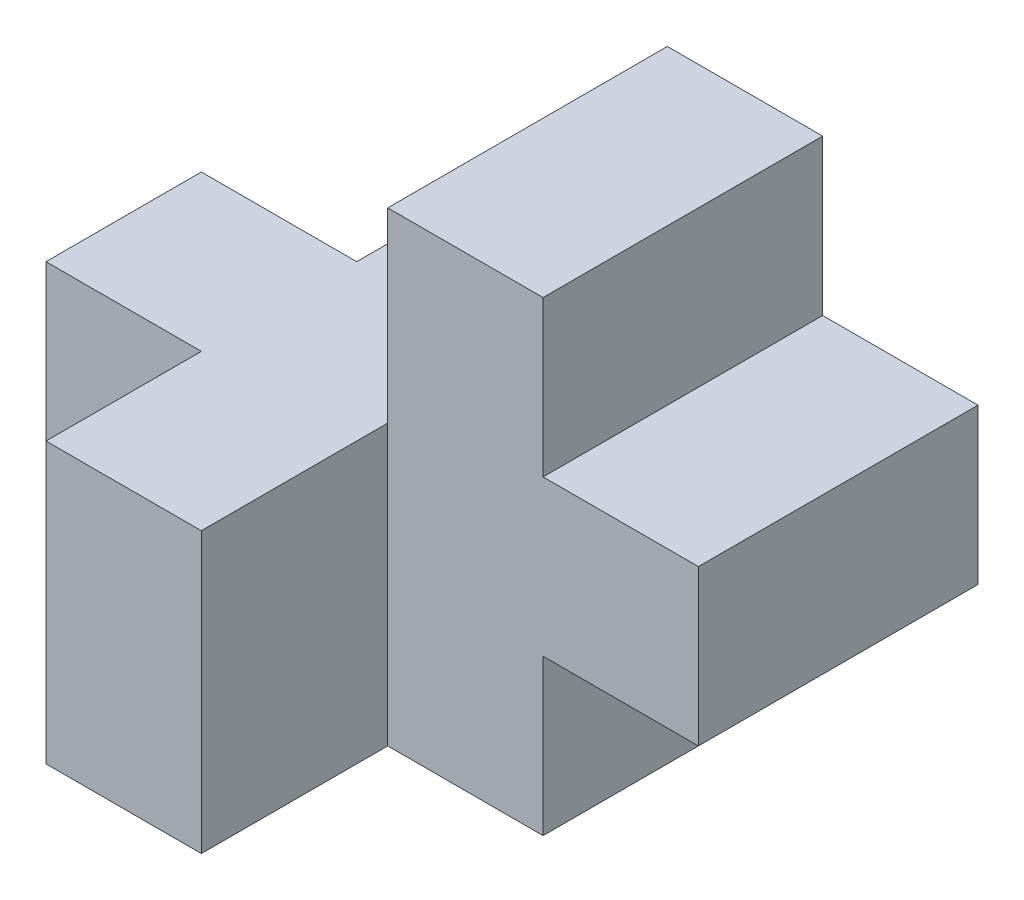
ISO-10303-21;
HEADER;
FILE_DESCRIPTION(('STEP AP214'),'2;1');
FILE_NAME('part.step','',(''),(''),'','','');
FILE_SCHEMA(('AUTOMOTIVE_DESIGN { 1 0 10303 214 1 1 1 1 }'));
ENDSEC;
DATA;
#1=APPLICATION_CONTEXT('core data for automotive mechanical design processes');
#2=APPLICATION_PROTOCOL_DEFINITION('international standard','automotive_design',2000,#1);
#3=PRODUCT_CONTEXT('',#1,'mechanical');
#4=PRODUCT('Part','Part','',(#3));
#5=PRODUCT_RELATED_PRODUCT_CATEGORY('part','',(#4));
#6=PRODUCT_DEFINITION_FORMATION('','',#4);
#7=PRODUCT_DEFINITION_CONTEXT('part definition',#1,'design');
#8=PRODUCT_DEFINITION('design','',#6,#7);
#9=PRODUCT_DEFINITION_SHAPE('','',#8);
#10=(LENGTH_UNIT() NAMED_UNIT(*) SI_UNIT(.MILLI.,.METRE.));
#11=(NAMED_UNIT(*) PLANE_ANGLE_UNIT() SI_UNIT($,.RADIAN.));
#12=(NAMED_UNIT(*) SI_UNIT($,.STERADIAN.) SOLID_ANGLE_UNIT());
#13=UNCERTAINTY_MEASURE_WITH_UNIT(LENGTH_MEASURE(1.E-05),#10,'distance_accuracy_value','');
#14=(GEOMETRIC_REPRESENTATION_CONTEXT(3) GLOBAL_UNCERTAINTY_ASSIGNED_CONTEXT((#13)) GLOBAL_UNIT_ASSIGNED_CONTEXT((#10,
#11,#12)) REPRESENTATION_CONTEXT('',''));
#15=CARTESIAN_POINT('',(0.,0.,0.));
#16=DIRECTION('',(0.,0.,1.));
#17=DIRECTION('',(1.,0.,0.));
#18=AXIS2_PLACEMENT_3D('',#15,#16,#17);
#19=CARTESIAN_POINT('',(0.,0.,-90.));
#20=DIRECTION('',(-1.,0.,0.));
#21=DIRECTION('',(0.,0.,1.));
#22=AXIS2_PLACEMENT_3D('',#19,#20,#21);
#23=PLANE('',#22);
#24=DIRECTION('',(0.,-1.,0.));
#25=VECTOR('',#24,1.);
#26=CARTESIAN_POINT('',(0.,-75.,-90.));
#27=LINE('',#26,#25);
#28=CARTESIAN_POINT('',(0.,75.,-90.));
#29=VERTEX_POINT('',#28);
#30=CARTESIAN_POINT('',(0.,15.,-90.));
#31=VERTEX_POINT('',#30);
#32=EDGE_CURVE('E57',#29,#31,#27,.T.);
#33=ORIENTED_EDGE('',*,*,#32,.T.);
#34=DIRECTION('',(0.,0.,1.));
#35=VECTOR('',#34,1.);
#36=CARTESIAN_POINT('',(0.,15.,60.));
#37=LINE('',#36,#35);
#38=CARTESIAN_POINT('',(0.,15.,0.));
#39=VERTEX_POINT('',#38);
#40=EDGE_CURVE('E225',#31,#39,#37,.T.);
#41=ORIENTED_EDGE('',*,*,#40,.T.);
#42=DIRECTION('',(0.,-1.,0.));
#43=VECTOR('',#42,1.);
#44=CARTESIAN_POINT('',(0.,0.,0.));
#45=LINE('',#44,#43);
#46=CARTESIAN_POINT('',(0.,75.,0.));
#47=VERTEX_POINT('',#46);
#48=EDGE_CURVE('E153',#47,#39,#45,.T.);
#49=ORIENTED_EDGE('',*,*,#48,.F.);
#50=DIRECTION('',(0.,0.,1.));
#51=VECTOR('',#50,1.);
#52=CARTESIAN_POINT('',(0.,75.,-90.));
#53=LINE('',#52,#51);
#54=EDGE_CURVE('E11',#29,#47,#53,.T.);
#55=ORIENTED_EDGE('',*,*,#54,.F.);
#56=EDGE_LOOP('',(#33,#41,#49,#55));
#57=FACE_BOUND('',#56,.T.);
#58=ADVANCED_FACE('F31',(#57),#23,.T.);
#59=CARTESIAN_POINT('',(0.,75.,-90.));
#60=DIRECTION('',(0.,1.,0.));
#61=DIRECTION('',(0.,0.,1.));
#62=AXIS2_PLACEMENT_3D('',#59,#60,#61);
#63=PLANE('',#62);
#64=DIRECTION('',(-1.,0.,0.));
#65=VECTOR('',#64,1.);
#66=CARTESIAN_POINT('',(0.,75.,0.));
#67=LINE('',#66,#65);
#68=CARTESIAN_POINT('',(50.,75.,0.));
#69=VERTEX_POINT('',#68);
#70=EDGE_CURVE('E150',#69,#47,#67,.T.);
#71=ORIENTED_EDGE('',*,*,#70,.F.);
#72=DIRECTION('',(0.,0.,1.));
#73=VECTOR('',#72,1.);
#74=CARTESIAN_POINT('',(50.,75.,-90.));
#75=LINE('',#74,#73);
#76=CARTESIAN_POINT('',(50.,75.,-90.));
#77=VERTEX_POINT('',#76);
#78=EDGE_CURVE('E40',#77,#69,#75,.T.);
#79=ORIENTED_EDGE('',*,*,#78,.F.);
#80=DIRECTION('',(-1.,0.,0.));
#81=VECTOR('',#80,1.);
#82=CARTESIAN_POINT('',(0.,75.,-90.));
#83=LINE('',#82,#81);
#84=EDGE_CURVE('E127',#77,#29,#83,.T.);
#85=ORIENTED_EDGE('',*,*,#84,.T.);
#86=ORIENTED_EDGE('',*,*,#54,.T.);
#87=EDGE_LOOP('',(#71,#79,#85,#86));
#88=FACE_BOUND('',#87,.T.);
#89=ADVANCED_FACE('F308',(#88),#63,.T.);
#90=CARTESIAN_POINT('',(50.,75.,-90.));
#91=DIRECTION('',(1.,0.,0.));
#92=DIRECTION('',(0.,1.,0.));
#93=AXIS2_PLACEMENT_3D('',#90,#91,#92);
#94=PLANE('',#93);
#95=DIRECTION('',(0.,1.,0.));
#96=VECTOR('',#95,1.);
#97=CARTESIAN_POINT('',(50.,75.,0.));
#98=LINE('',#97,#96);
#99=CARTESIAN_POINT('',(50.,25.,0.));
#100=VERTEX_POINT('',#99);
#101=EDGE_CURVE('E115',#100,#69,#98,.T.);
#102=ORIENTED_EDGE('',*,*,#101,.F.);
#103=DIRECTION('',(0.,0.,1.));
#104=VECTOR('',#103,1.);
#105=CARTESIAN_POINT('',(50.,25.,-90.));
#106=LINE('',#105,#104);
#107=CARTESIAN_POINT('',(50.,25.,-90.));
#108=VERTEX_POINT('',#107);
#109=EDGE_CURVE('E110',#108,#100,#106,.T.);
#110=ORIENTED_EDGE('',*,*,#109,.F.);
#111=DIRECTION('',(0.,1.,0.));
#112=VECTOR('',#111,1.);
#113=CARTESIAN_POINT('',(50.,75.,-90.));
#114=LINE('',#113,#112);
#115=EDGE_CURVE('E113',#108,#77,#114,.T.);
#116=ORIENTED_EDGE('',*,*,#115,.T.);
#117=ORIENTED_EDGE('',*,*,#78,.T.);
#118=EDGE_LOOP('',(#102,#110,#116,#117));
#119=FACE_BOUND('',#118,.T.);
#120=ADVANCED_FACE('F112',(#119),#94,.T.);
#121=CARTESIAN_POINT('',(50.,25.,-90.));
#122=DIRECTION('',(0.,1.,0.));
#123=DIRECTION('',(0.,0.,1.));
#124=AXIS2_PLACEMENT_3D('',#121,#122,#123);
#125=PLANE('',#124);
#126=DIRECTION('',(-1.,0.,0.));
#127=VECTOR('',#126,1.);
#128=CARTESIAN_POINT('',(50.,25.,0.));
#129=LINE('',#128,#127);
#130=CARTESIAN_POINT('',(100.,25.,0.));
#131=VERTEX_POINT('',#130);
#132=EDGE_CURVE('E147',#131,#100,#129,.T.);
#133=ORIENTED_EDGE('',*,*,#132,.F.);
#134=DIRECTION('',(0.,0.,1.));
#135=VECTOR('',#134,1.);
#136=CARTESIAN_POINT('',(100.,25.,-90.));
#137=LINE('',#136,#135);
#138=CARTESIAN_POINT('',(100.,25.,-90.));
#139=VERTEX_POINT('',#138);
#140=EDGE_CURVE('E120',#139,#131,#137,.T.);
#141=ORIENTED_EDGE('',*,*,#140,.F.);
#142=DIRECTION('',(-1.,0.,0.));
#143=VECTOR('',#142,1.);
#144=CARTESIAN_POINT('',(50.,25.,-90.));
#145=LINE('',#144,#143);
#146=EDGE_CURVE('E125',#139,#108,#145,.T.);
#147=ORIENTED_EDGE('',*,*,#146,.T.);
#148=ORIENTED_EDGE('',*,*,#109,.T.);
#149=EDGE_LOOP('',(#133,#141,#147,#148));
#150=FACE_BOUND('',#149,.T.);
#151=ADVANCED_FACE('F129',(#150),#125,.T.);
#152=CARTESIAN_POINT('',(100.,25.,-90.));
#153=DIRECTION('',(1.,0.,0.));
#154=DIRECTION('',(0.,0.,-1.));
#155=AXIS2_PLACEMENT_3D('',#152,#153,#154);
#156=PLANE('',#155);
#157=DIRECTION('',(0.,1.,0.));
#158=VECTOR('',#157,1.);
#159=CARTESIAN_POINT('',(100.,25.,0.));
#160=LINE('',#159,#158);
#161=CARTESIAN_POINT('',(100.,-25.,0.));
#162=VERTEX_POINT('',#161);
#163=EDGE_CURVE('E144',#162,#131,#160,.T.);
#164=ORIENTED_EDGE('',*,*,#163,.F.);
#165=DIRECTION('',(0.,0.,1.));
#166=VECTOR('',#165,1.);
#167=CARTESIAN_POINT('',(100.,-25.,-90.));
#168=LINE('',#167,#166);
#169=CARTESIAN_POINT('',(100.,-25.,-90.));
#170=VERTEX_POINT('',#169);
#171=EDGE_CURVE('E339',#170,#162,#168,.T.);
#172=ORIENTED_EDGE('',*,*,#171,.F.);
#173=DIRECTION('',(0.,1.,0.));
#174=VECTOR('',#173,1.);
#175=CARTESIAN_POINT('',(100.,25.,-90.));
#176=LINE('',#175,#174);
#177=EDGE_CURVE('E130',#170,#139,#176,.T.);
#178=ORIENTED_EDGE('',*,*,#177,.T.);
#179=ORIENTED_EDGE('',*,*,#140,.T.);
#180=EDGE_LOOP('',(#164,#172,#178,#179));
#181=FACE_BOUND('',#180,.T.);
#182=ADVANCED_FACE('F322',(#181),#156,.T.);
#183=CARTESIAN_POINT('',(100.,-25.,-90.));
#184=DIRECTION('',(0.,-1.,0.));
#185=DIRECTION('',(1.,0.,0.));
#186=AXIS2_PLACEMENT_3D('',#183,#184,#185);
#187=PLANE('',#186);
#188=DIRECTION('',(1.,0.,0.));
#189=VECTOR('',#188,1.);
#190=CARTESIAN_POINT('',(100.,-25.,0.));
#191=LINE('',#190,#189);
#192=CARTESIAN_POINT('',(50.,-25.,0.));
#193=VERTEX_POINT('',#192);
#194=EDGE_CURVE('E140',#193,#162,#191,.T.);
#195=ORIENTED_EDGE('',*,*,#194,.F.);
#196=DIRECTION('',(0.,0.,1.));
#197=VECTOR('',#196,1.);
#198=CARTESIAN_POINT('',(50.,-25.,-90.));
#199=LINE('',#198,#197);
#200=CARTESIAN_POINT('',(50.,-25.,-90.));
#201=VERTEX_POINT('',#200);
#202=EDGE_CURVE('E334',#201,#193,#199,.T.);
#203=ORIENTED_EDGE('',*,*,#202,.F.);
#204=DIRECTION('',(1.,0.,0.));
#205=VECTOR('',#204,1.);
#206=CARTESIAN_POINT('',(100.,-25.,-90.));
#207=LINE('',#206,#205);
#208=EDGE_CURVE('E132',#201,#170,#207,.T.);
#209=ORIENTED_EDGE('',*,*,#208,.T.);
#210=ORIENTED_EDGE('',*,*,#171,.T.);
#211=EDGE_LOOP('',(#195,#203,#209,#210));
#212=FACE_BOUND('',#211,.T.);
#213=ADVANCED_FACE('F325',(#212),#187,.T.);
#214=CARTESIAN_POINT('',(50.,-25.,-90.));
#215=DIRECTION('',(1.,0.,0.));
#216=DIRECTION('',(0.,1.,0.));
#217=AXIS2_PLACEMENT_3D('',#214,#215,#216);
#218=PLANE('',#217);
#219=DIRECTION('',(0.,1.,0.));
#220=VECTOR('',#219,1.);
#221=CARTESIAN_POINT('',(50.,-25.,0.));
#222=LINE('',#221,#220);
#223=CARTESIAN_POINT('',(50.,-75.,0.));
#224=VERTEX_POINT('',#223);
#225=EDGE_CURVE('E137',#224,#193,#222,.T.);
#226=ORIENTED_EDGE('',*,*,#225,.F.);
#227=DIRECTION('',(0.,0.,1.));
#228=VECTOR('',#227,1.);
#229=CARTESIAN_POINT('',(50.,-75.,-90.));
#230=LINE('',#229,#228);
#231=CARTESIAN_POINT('',(50.,-75.,-90.));
#232=VERTEX_POINT('',#231);
#233=EDGE_CURVE('E94',#232,#224,#230,.T.);
#234=ORIENTED_EDGE('',*,*,#233,.F.);
#235=DIRECTION('',(0.,1.,0.));
#236=VECTOR('',#235,1.);
#237=CARTESIAN_POINT('',(50.,-25.,-90.));
#238=LINE('',#237,#236);
#239=EDGE_CURVE('E353',#232,#201,#238,.T.);
#240=ORIENTED_EDGE('',*,*,#239,.T.);
#241=ORIENTED_EDGE('',*,*,#202,.T.);
#242=EDGE_LOOP('',(#226,#234,#240,#241));
#243=FACE_BOUND('',#242,.T.);
#244=ADVANCED_FACE('F328',(#243),#218,.T.);
#245=CARTESIAN_POINT('',(50.,-75.,-90.));
#246=DIRECTION('',(0.,-1.,0.));
#247=DIRECTION('',(0.,0.,-1.));
#248=AXIS2_PLACEMENT_3D('',#245,#246,#247);
#249=PLANE('',#248);
#250=DIRECTION('',(1.,0.,0.));
#251=VECTOR('',#250,1.);
#252=CARTESIAN_POINT('',(50.,-75.,0.));
#253=LINE('',#252,#251);
#254=CARTESIAN_POINT('',(0.,-75.,0.));
#255=VERTEX_POINT('',#254);
#256=EDGE_CURVE('E141',#255,#224,#253,.T.);
#257=ORIENTED_EDGE('',*,*,#256,.F.);
#258=DIRECTION('',(0.,0.,1.));
#259=VECTOR('',#258,1.);
#260=CARTESIAN_POINT('',(0.,-75.,60.));
#261=LINE('',#260,#259);
#262=CARTESIAN_POINT('',(0.,-75.,60.));
#263=VERTEX_POINT('',#262);
#264=EDGE_CURVE('E197',#255,#263,#261,.T.);
#265=ORIENTED_EDGE('',*,*,#264,.T.);
#266=DIRECTION('',(-1.,0.,0.));
#267=VECTOR('',#266,1.);
#268=CARTESIAN_POINT('',(-50.,-75.,60.));
#269=LINE('',#268,#267);
#270=CARTESIAN_POINT('',(-50.,-75.,60.));
#271=VERTEX_POINT('',#270);
#272=EDGE_CURVE('E201',#263,#271,#269,.T.);
#273=ORIENTED_EDGE('',*,*,#272,.T.);
#274=DIRECTION('',(0.,0.,-1.));
#275=VECTOR('',#274,1.);
#276=CARTESIAN_POINT('',(-50.,-75.,10.));
#277=LINE('',#276,#275);
#278=CARTESIAN_POINT('',(-50.,-75.,10.));
#279=VERTEX_POINT('',#278);
#280=EDGE_CURVE('E211',#271,#279,#277,.T.);
#281=ORIENTED_EDGE('',*,*,#280,.T.);
#282=DIRECTION('',(-1.,0.,0.));
#283=VECTOR('',#282,1.);
#284=CARTESIAN_POINT('',(-100.,-75.,10.));
#285=LINE('',#284,#283);
#286=CARTESIAN_POINT('',(-100.,-75.,10.));
#287=VERTEX_POINT('',#286);
#288=EDGE_CURVE('E214',#279,#287,#285,.T.);
#289=ORIENTED_EDGE('',*,*,#288,.T.);
#290=DIRECTION('',(0.,0.,-1.));
#291=VECTOR('',#290,1.);
#292=CARTESIAN_POINT('',(-100.,-75.,-40.));
#293=LINE('',#292,#291);
#294=CARTESIAN_POINT('',(-100.,-75.,-40.));
#295=VERTEX_POINT('',#294);
#296=EDGE_CURVE('E217',#287,#295,#293,.T.);
#297=ORIENTED_EDGE('',*,*,#296,.T.);
#298=DIRECTION('',(1.,0.,0.));
#299=VECTOR('',#298,1.);
#300=CARTESIAN_POINT('',(-50.,-75.,-40.));
#301=LINE('',#300,#299);
#302=CARTESIAN_POINT('',(-50.,-75.,-40.));
#303=VERTEX_POINT('',#302);
#304=EDGE_CURVE('E219',#295,#303,#301,.T.);
#305=ORIENTED_EDGE('',*,*,#304,.T.);
#306=DIRECTION('',(0.,0.,-1.));
#307=VECTOR('',#306,1.);
#308=CARTESIAN_POINT('',(-50.,-75.,-90.));
#309=LINE('',#308,#307);
#310=CARTESIAN_POINT('',(-50.,-75.,-90.));
#311=VERTEX_POINT('',#310);
#312=EDGE_CURVE('E179',#303,#311,#309,.T.);
#313=ORIENTED_EDGE('',*,*,#312,.T.);
#314=DIRECTION('',(1.,0.,0.));
#315=VECTOR('',#314,1.);
#316=CARTESIAN_POINT('',(50.,-75.,-90.));
#317=LINE('',#316,#315);
#318=EDGE_CURVE('E351',#311,#232,#317,.T.);
#319=ORIENTED_EDGE('',*,*,#318,.T.);
#320=ORIENTED_EDGE('',*,*,#233,.T.);
#321=EDGE_LOOP('',(#257,#265,#273,#281,#289,#297,#305,#313,#319,#320));
#322=FACE_BOUND('',#321,.T.);
#323=ADVANCED_FACE('F33',(#322),#249,.T.);
#324=CARTESIAN_POINT('',(0.,75.,-90.));
#325=DIRECTION('',(0.,0.,-1.));
#326=DIRECTION('',(-1.,0.,0.));
#327=AXIS2_PLACEMENT_3D('',#324,#325,#326);
#328=PLANE('',#327);
#329=ORIENTED_EDGE('',*,*,#32,.F.);
#330=ORIENTED_EDGE('',*,*,#84,.F.);
#331=ORIENTED_EDGE('',*,*,#115,.F.);
#332=ORIENTED_EDGE('',*,*,#146,.F.);
#333=ORIENTED_EDGE('',*,*,#177,.F.);
#334=ORIENTED_EDGE('',*,*,#208,.F.);
#335=ORIENTED_EDGE('',*,*,#239,.F.);
#336=ORIENTED_EDGE('',*,*,#318,.F.);
#337=DIRECTION('',(0.,-1.,0.));
#338=VECTOR('',#337,1.);
#339=CARTESIAN_POINT('',(-50.,15.,-90.));
#340=LINE('',#339,#338);
#341=CARTESIAN_POINT('',(-50.,15.,-90.));
#342=VERTEX_POINT('',#341);
#343=EDGE_CURVE('E163',#342,#311,#340,.T.);
#344=ORIENTED_EDGE('',*,*,#343,.F.);
#345=DIRECTION('',(1.,0.,0.));
#346=VECTOR('',#345,1.);
#347=CARTESIAN_POINT('',(0.,15.,-90.));
#348=LINE('',#347,#346);
#349=EDGE_CURVE('E196',#342,#31,#348,.T.);
#350=ORIENTED_EDGE('',*,*,#349,.T.);
#351=EDGE_LOOP('',(#329,#330,#331,#332,#333,#334,#335,#336,#344,#350));
#352=FACE_BOUND('',#351,.T.);
#353=ADVANCED_FACE('F123',(#352),#328,.T.);
#354=CARTESIAN_POINT('',(0.,75.,0.));
#355=DIRECTION('',(0.,0.,-1.));
#356=DIRECTION('',(-1.,0.,0.));
#357=AXIS2_PLACEMENT_3D('',#354,#355,#356);
#358=PLANE('',#357);
#359=ORIENTED_EDGE('',*,*,#48,.T.);
#360=EDGE_CURVE('E152',#39,#255,#45,.T.);
#361=ORIENTED_EDGE('',*,*,#360,.T.);
#362=ORIENTED_EDGE('',*,*,#256,.T.);
#363=ORIENTED_EDGE('',*,*,#225,.T.);
#364=ORIENTED_EDGE('',*,*,#194,.T.);
#365=ORIENTED_EDGE('',*,*,#163,.T.);
#366=ORIENTED_EDGE('',*,*,#132,.T.);
#367=ORIENTED_EDGE('',*,*,#101,.T.);
#368=ORIENTED_EDGE('',*,*,#70,.T.);
#369=EDGE_LOOP('',(#359,#361,#362,#363,#364,#365,#366,#367,#368));
#370=FACE_BOUND('',#369,.T.);
#371=ADVANCED_FACE('F304',(#370),#358,.F.);
#372=CARTESIAN_POINT('',(0.,15.,60.));
#373=DIRECTION('',(1.,0.,0.));
#374=DIRECTION('',(0.,0.,-1.));
#375=AXIS2_PLACEMENT_3D('',#372,#373,#374);
#376=PLANE('',#375);
#377=ORIENTED_EDGE('',*,*,#360,.F.);
#378=CARTESIAN_POINT('',(0.,15.,60.));
#379=VERTEX_POINT('',#378);
#380=EDGE_CURVE('E48',#39,#379,#37,.T.);
#381=ORIENTED_EDGE('',*,*,#380,.T.);
#382=DIRECTION('',(0.,-1.,0.));
#383=VECTOR('',#382,1.);
#384=CARTESIAN_POINT('',(0.,15.,60.));
#385=LINE('',#384,#383);
#386=EDGE_CURVE('E193',#379,#263,#385,.T.);
#387=ORIENTED_EDGE('',*,*,#386,.T.);
#388=ORIENTED_EDGE('',*,*,#264,.F.);
#389=EDGE_LOOP('',(#377,#381,#387,#388));
#390=FACE_BOUND('',#389,.T.);
#391=ADVANCED_FACE('F296',(#390),#376,.T.);
#392=CARTESIAN_POINT('',(-50.,15.,-90.));
#393=DIRECTION('',(-1.,0.,0.));
#394=DIRECTION('',(0.,0.,1.));
#395=AXIS2_PLACEMENT_3D('',#392,#393,#394);
#396=PLANE('',#395);
#397=ORIENTED_EDGE('',*,*,#312,.F.);
#398=DIRECTION('',(0.,-1.,0.));
#399=VECTOR('',#398,1.);
#400=CARTESIAN_POINT('',(-50.,15.,-40.));
#401=LINE('',#400,#399);
#402=CARTESIAN_POINT('',(-50.,15.,-40.));
#403=VERTEX_POINT('',#402);
#404=EDGE_CURVE('E167',#403,#303,#401,.T.);
#405=ORIENTED_EDGE('',*,*,#404,.F.);
#406=DIRECTION('',(0.,0.,-1.));
#407=VECTOR('',#406,1.);
#408=CARTESIAN_POINT('',(-50.,15.,-90.));
#409=LINE('',#408,#407);
#410=EDGE_CURVE('E207',#403,#342,#409,.T.);
#411=ORIENTED_EDGE('',*,*,#410,.T.);
#412=ORIENTED_EDGE('',*,*,#343,.T.);
#413=EDGE_LOOP('',(#397,#405,#411,#412));
#414=FACE_BOUND('',#413,.T.);
#415=ADVANCED_FACE('F294',(#414),#396,.T.);
#416=CARTESIAN_POINT('',(-50.,15.,-40.));
#417=DIRECTION('',(0.,0.,-1.));
#418=DIRECTION('',(-1.,0.,0.));
#419=AXIS2_PLACEMENT_3D('',#416,#417,#418);
#420=PLANE('',#419);
#421=ORIENTED_EDGE('',*,*,#304,.F.);
#422=DIRECTION('',(0.,-1.,0.));
#423=VECTOR('',#422,1.);
#424=CARTESIAN_POINT('',(-100.,15.,-40.));
#425=LINE('',#424,#423);
#426=CARTESIAN_POINT('',(-100.,15.,-40.));
#427=VERTEX_POINT('',#426);
#428=EDGE_CURVE('E176',#427,#295,#425,.T.);
#429=ORIENTED_EDGE('',*,*,#428,.F.);
#430=DIRECTION('',(1.,0.,0.));
#431=VECTOR('',#430,1.);
#432=CARTESIAN_POINT('',(-50.,15.,-40.));
#433=LINE('',#432,#431);
#434=EDGE_CURVE('E240',#427,#403,#433,.T.);
#435=ORIENTED_EDGE('',*,*,#434,.T.);
#436=ORIENTED_EDGE('',*,*,#404,.T.);
#437=EDGE_LOOP('',(#421,#429,#435,#436));
#438=FACE_BOUND('',#437,.T.);
#439=ADVANCED_FACE('F293',(#438),#420,.T.);
#440=CARTESIAN_POINT('',(-100.,15.,-40.));
#441=DIRECTION('',(-1.,0.,0.));
#442=DIRECTION('',(0.,0.,1.));
#443=AXIS2_PLACEMENT_3D('',#440,#441,#442);
#444=PLANE('',#443);
#445=ORIENTED_EDGE('',*,*,#296,.F.);
#446=DIRECTION('',(0.,-1.,0.));
#447=VECTOR('',#446,1.);
#448=CARTESIAN_POINT('',(-100.,15.,10.));
#449=LINE('',#448,#447);
#450=CARTESIAN_POINT('',(-100.,15.,10.));
#451=VERTEX_POINT('',#450);
#452=EDGE_CURVE('E184',#451,#287,#449,.T.);
#453=ORIENTED_EDGE('',*,*,#452,.F.);
#454=DIRECTION('',(0.,0.,-1.));
#455=VECTOR('',#454,1.);
#456=CARTESIAN_POINT('',(-100.,15.,-40.));
#457=LINE('',#456,#455);
#458=EDGE_CURVE('E245',#451,#427,#457,.T.);
#459=ORIENTED_EDGE('',*,*,#458,.T.);
#460=ORIENTED_EDGE('',*,*,#428,.T.);
#461=EDGE_LOOP('',(#445,#453,#459,#460));
#462=FACE_BOUND('',#461,.T.);
#463=ADVANCED_FACE('F302',(#462),#444,.T.);
#464=CARTESIAN_POINT('',(-100.,15.,10.));
#465=DIRECTION('',(0.,0.,1.));
#466=DIRECTION('',(1.,0.,0.));
#467=AXIS2_PLACEMENT_3D('',#464,#465,#466);
#468=PLANE('',#467);
#469=ORIENTED_EDGE('',*,*,#288,.F.);
#470=DIRECTION('',(0.,-1.,0.));
#471=VECTOR('',#470,1.);
#472=CARTESIAN_POINT('',(-50.,15.,10.));
#473=LINE('',#472,#471);
#474=CARTESIAN_POINT('',(-50.,15.,10.));
#475=VERTEX_POINT('',#474);
#476=EDGE_CURVE('E187',#475,#279,#473,.T.);
#477=ORIENTED_EDGE('',*,*,#476,.F.);
#478=DIRECTION('',(-1.,0.,0.));
#479=VECTOR('',#478,1.);
#480=CARTESIAN_POINT('',(-100.,15.,10.));
#481=LINE('',#480,#479);
#482=EDGE_CURVE('E251',#475,#451,#481,.T.);
#483=ORIENTED_EDGE('',*,*,#482,.T.);
#484=ORIENTED_EDGE('',*,*,#452,.T.);
#485=EDGE_LOOP('',(#469,#477,#483,#484));
#486=FACE_BOUND('',#485,.T.);
#487=ADVANCED_FACE('F348',(#486),#468,.T.);
#488=CARTESIAN_POINT('',(-50.,15.,10.));
#489=DIRECTION('',(-1.,0.,0.));
#490=DIRECTION('',(0.,0.,1.));
#491=AXIS2_PLACEMENT_3D('',#488,#489,#490);
#492=PLANE('',#491);
#493=ORIENTED_EDGE('',*,*,#280,.F.);
#494=DIRECTION('',(0.,-1.,0.));
#495=VECTOR('',#494,1.);
#496=CARTESIAN_POINT('',(-50.,15.,60.));
#497=LINE('',#496,#495);
#498=CARTESIAN_POINT('',(-50.,15.,60.));
#499=VERTEX_POINT('',#498);
#500=EDGE_CURVE('E190',#499,#271,#497,.T.);
#501=ORIENTED_EDGE('',*,*,#500,.F.);
#502=DIRECTION('',(0.,0.,-1.));
#503=VECTOR('',#502,1.);
#504=CARTESIAN_POINT('',(-50.,15.,10.));
#505=LINE('',#504,#503);
#506=EDGE_CURVE('E255',#499,#475,#505,.T.);
#507=ORIENTED_EDGE('',*,*,#506,.T.);
#508=ORIENTED_EDGE('',*,*,#476,.T.);
#509=EDGE_LOOP('',(#493,#501,#507,#508));
#510=FACE_BOUND('',#509,.T.);
#511=ADVANCED_FACE('F349',(#510),#492,.T.);
#512=CARTESIAN_POINT('',(-50.,15.,60.));
#513=DIRECTION('',(0.,0.,1.));
#514=DIRECTION('',(1.,0.,0.));
#515=AXIS2_PLACEMENT_3D('',#512,#513,#514);
#516=PLANE('',#515);
#517=ORIENTED_EDGE('',*,*,#272,.F.);
#518=ORIENTED_EDGE('',*,*,#386,.F.);
#519=DIRECTION('',(-1.,0.,0.));
#520=VECTOR('',#519,1.);
#521=CARTESIAN_POINT('',(-50.,15.,60.));
#522=LINE('',#521,#520);
#523=EDGE_CURVE('E231',#379,#499,#522,.T.);
#524=ORIENTED_EDGE('',*,*,#523,.T.);
#525=ORIENTED_EDGE('',*,*,#500,.T.);
#526=EDGE_LOOP('',(#517,#518,#524,#525));
#527=FACE_BOUND('',#526,.T.);
#528=ADVANCED_FACE('F265',(#527),#516,.T.);
#529=CARTESIAN_POINT('',(0.,15.,-90.));
#530=DIRECTION('',(0.,1.,0.));
#531=DIRECTION('',(0.,0.,1.));
#532=AXIS2_PLACEMENT_3D('',#529,#530,#531);
#533=PLANE('',#532);
#534=ORIENTED_EDGE('',*,*,#40,.F.);
#535=ORIENTED_EDGE('',*,*,#349,.F.);
#536=ORIENTED_EDGE('',*,*,#410,.F.);
#537=ORIENTED_EDGE('',*,*,#434,.F.);
#538=ORIENTED_EDGE('',*,*,#458,.F.);
#539=ORIENTED_EDGE('',*,*,#482,.F.);
#540=ORIENTED_EDGE('',*,*,#506,.F.);
#541=ORIENTED_EDGE('',*,*,#523,.F.);
#542=ORIENTED_EDGE('',*,*,#380,.F.);
#543=EDGE_LOOP('',(#534,#535,#536,#537,#538,#539,#540,#541,#542));
#544=FACE_BOUND('',#543,.T.);
#545=ADVANCED_FACE('F269',(#544),#533,.T.);
#546=CLOSED_SHELL('',(#58,#89,#120,#151,#182,#213,#244,#323,#353,#371,#391,#415,#439,#463,#487,
#511,#528,#545));
#547=MANIFOLD_SOLID_BREP('B2',#546);
#548=ADVANCED_BREP_SHAPE_REPRESENTATION('',(#18,#547),#14);
#549=SHAPE_DEFINITION_REPRESENTATION(#9,#548);
ENDSEC;
END-ISO-10303-21;
